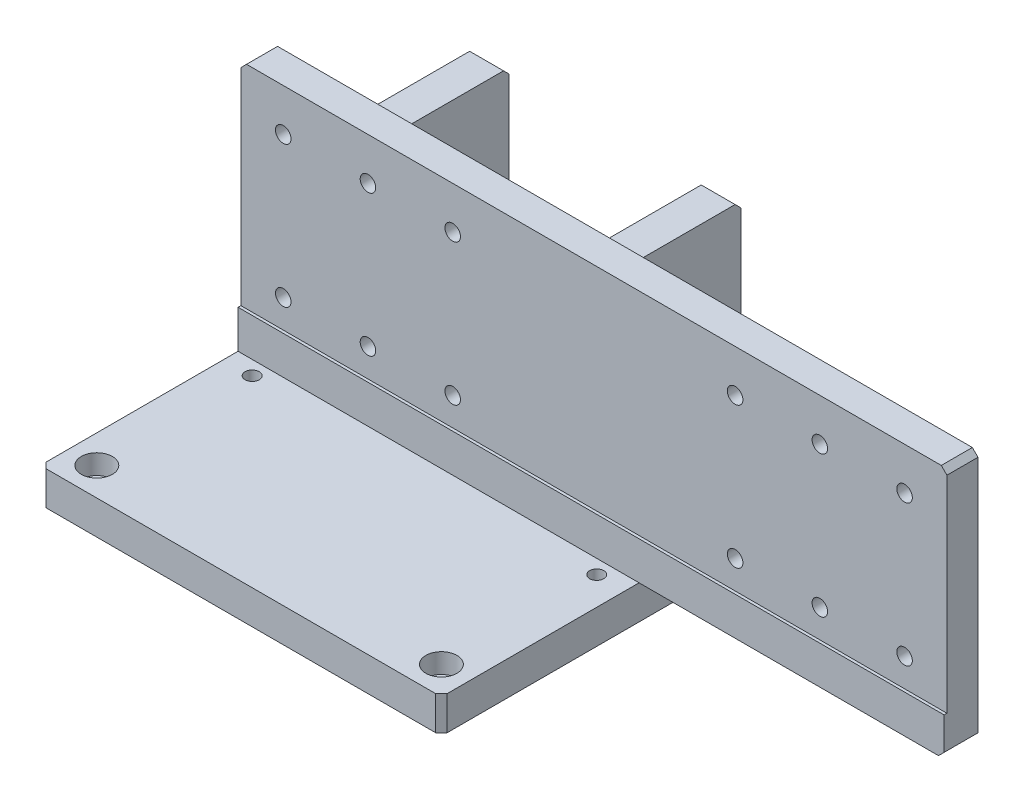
from build123d import *

# Parameters (mm, degrees)
SKETCH_1_W                  = 142
SKETCH_1_H                  = 130
EXTRUDE_1_DEPTH             = 12
SKETCH_2_W                  = 250
SKETCH_2_H                  = 12
EXTRUDE_2_DEPTH             = 88.5
SKETCH_3_W                  = 12
SKETCH_3_H                  = 48
EXTRUDE_3_DEPTH             = 75
EXTRUDE_3_2_DEPTH           = 75
CUT_EXTRUDE_1_DEPTH         = 179.183192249
CUT_EXTRUDE_1_DEPTH_BACK    = 179.183192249
HOLE_WIZARD_M6_1_AT_2_COUNT = 2
HOLE_WIZARD_M6_1_AT_2_PITCH = 122
HOLE_WIZARD_M6_1_AT_3_COUNT = 2
HOLE_WIZARD_M6_1_AT_3_PITCH = 110
HOLE_WIZARD_M6_1_AT_4_COUNT = 2
HOLE_WIZARD_M6_1_AT_4_PITCH = 164.268073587
SKETCH_8_W                  = 2.5
SKETCH_8_H                  = 12
F_5_0MM_1_AT_2_COUNT        = 2
F_5_0MM_1_AT_2_PITCH        = 122
HOLE_WIZARD_M5_1_AT_2_COUNT = 2
HOLE_WIZARD_M5_1_AT_2_PITCH = 30
HOLE_WIZARD_M5_1_AT_3_COUNT = 2
HOLE_WIZARD_M5_1_AT_3_PITCH = 60
HOLE_WIZARD_M5_1_AT_4_COUNT = 2
HOLE_WIZARD_M5_1_AT_4_PITCH = 50
HOLE_WIZARD_M5_1_AT_5_COUNT = 2
HOLE_WIZARD_M5_1_AT_5_PITCH = 58.309518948
HOLE_WIZARD_M5_1_AT_6_COUNT = 2
HOLE_WIZARD_M5_1_AT_6_PITCH = 78.102496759
HOLE_WIZARD_M4_1_AT_2_COUNT = 2
HOLE_WIZARD_M4_1_AT_2_PITCH = 28
PATTERN_LINEAR_1_COUNT      = 2
PATTERN_LINEAR_1_PITCH      = 160
SKETCH_13_W                 = 250
SKETCH_13_H                 = 75
CUT_EXTRUDE_2_DEPTH         = 1
CHAMFER_3_SIZE              = 2
CHAMFER_4_SIZE              = 2


with BuildPart() as part:
    # Sketch 1 → Extrude 1 (new body)
    with BuildSketch(Plane(origin=(0, 0, 0), x_dir=(1, 0, 0), z_dir=(0, 1, 0))):
        Rectangle(SKETCH_1_W, SKETCH_1_H)
    extrude(amount=EXTRUDE_1_DEPTH)

    # Sketch 6 → Hole Wizard M6 _ _ _ _ _1 (revolve, cut)
    with BuildSketch(Plane(origin=(-61, 12, -55), x_dir=(0, 0, 1), z_dir=(1, 0, 0))):
        Polygon((0, 0), (0, 12), (3.3, 12), (3.3, 7), (5.5, 7), (5.5, 0), align=None)
    hole_wizard_m6_1 = revolve(axis=Axis((-61, 18.35, -55), (0, -1, 0)), mode=Mode.SUBTRACT)

    # Hole Wizard M6 _ _ _ _ _1 at 2: Hole Wizard M6 _ _ _ _ _1 ×2
    with Locations(*[(i * HOLE_WIZARD_M6_1_AT_2_PITCH, 0, 0) for i in range(1, HOLE_WIZARD_M6_1_AT_2_COUNT)]):
        add(hole_wizard_m6_1, mode=Mode.SUBTRACT)

    # Hole Wizard M6 _ _ _ _ _1 at 3: Hole Wizard M6 _ _ _ _ _1 ×2
    with Locations(*[(0, 0, i * HOLE_WIZARD_M6_1_AT_3_PITCH) for i in range(1, HOLE_WIZARD_M6_1_AT_3_COUNT)]):
        add(hole_wizard_m6_1, mode=Mode.SUBTRACT)

    # Hole Wizard M6 _ _ _ _ _1 at 4: Hole Wizard M6 _ _ _ _ _1 ×2
    with Locations(*[Vector(0.742688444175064, 0, 0.6696371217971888) * (i * HOLE_WIZARD_M6_1_AT_4_PITCH) for i in range(1, HOLE_WIZARD_M6_1_AT_4_COUNT)]):
        add(hole_wizard_m6_1, mode=Mode.SUBTRACT)

    # Sketch 8 → 5.0mm _ _1 (revolve, cut)
    with BuildSketch(Plane(origin=(-61, 12, 0), x_dir=(0, 0, 1), z_dir=(1, 0, 0))):
        with Locations((1.25, 6)):
            Rectangle(SKETCH_8_W, SKETCH_8_H)
    f_5_0mm_1 = revolve(axis=Axis((-61, 18.35, 0), (0, -1, 0)), mode=Mode.SUBTRACT)

    # 5.0mm _ _1 at 2: 5.0mm _ _1 ×2
    with Locations(*[(i * F_5_0MM_1_AT_2_PITCH, 0, 0) for i in range(1, F_5_0MM_1_AT_2_COUNT)]):
        add(f_5_0mm_1, mode=Mode.SUBTRACT)

    # Sketch 12 → Hole Wizard M4 _ _1 (revolve, cut)
    with BuildSketch(Plane(origin=(-71, 6, -51), x_dir=(0, 0, 1), z_dir=(0, 1, 0))):
        Polygon((0, 0), (0, 4.991420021), (1.65, 4), (1.65, 0.375), (2.025, 0), align=None)
    hole_wizard_m4_1 = revolve(axis=Axis((-77.35, 6, -51), (1, 0, 0)), mode=Mode.SUBTRACT)

    # Hole Wizard M4 _ _1 at 2: Hole Wizard M4 _ _1 ×2
    with Locations(*[(0, 0, i * HOLE_WIZARD_M4_1_AT_2_PITCH) for i in range(1, HOLE_WIZARD_M4_1_AT_2_COUNT)]):
        add(hole_wizard_m4_1, mode=Mode.SUBTRACT)

    # Chamfer 4
    chamfer_4_edges = [part.edges().sort_by_distance(p)[0] for p in [
        (71, 6, 65),
        (-71, 6, 65),
        (-71, 6, -65),
        (71, 6, -65),
    ]]
    chamfer(chamfer_4_edges, length=CHAMFER_4_SIZE)


with BuildPart() as body_2:
    # Sketch 2 → Extrude 2 (new body)
    with BuildSketch(Plane(origin=(0, 12, 0), x_dir=(1, 0, 0), z_dir=(0, 1, 0))):
        with Locations((54, 11)):
            Rectangle(SKETCH_2_W, SKETCH_2_H)
    extrude(amount=EXTRUDE_2_DEPTH)

    # Sketch 10 → Hole Wizard M5 _ _ _ _ _1 (revolve, cut)
    with BuildSketch(Plane(origin=(4, 85.5, -17), x_dir=(0, 1, 0), z_dir=(1, 0, 0))):
        Polygon((0, 0), (0, 12), (2.75, 12), (2.75, 6), (4.75, 6), (4.75, 0), align=None)
    hole_wizard_m5_1 = revolve(axis=Axis((4, 85.5, -23.35), (0, 0, 1)), mode=Mode.SUBTRACT)

    # Hole Wizard M5 _ _ _ _ _1 at 2: Hole Wizard M5 _ _ _ _ _1 ×2
    with Locations(*[(-i * HOLE_WIZARD_M5_1_AT_2_PITCH, 0, 0) for i in range(1, HOLE_WIZARD_M5_1_AT_2_COUNT)]):
        add(hole_wizard_m5_1, mode=Mode.SUBTRACT)

    # Hole Wizard M5 _ _ _ _ _1 at 3: Hole Wizard M5 _ _ _ _ _1 ×2
    with Locations(*[(-i * HOLE_WIZARD_M5_1_AT_3_PITCH, 0, 0) for i in range(1, HOLE_WIZARD_M5_1_AT_3_COUNT)]):
        add(hole_wizard_m5_1, mode=Mode.SUBTRACT)

    # Hole Wizard M5 _ _ _ _ _1 at 4: Hole Wizard M5 _ _ _ _ _1 ×2
    with Locations(*[(0, -i * HOLE_WIZARD_M5_1_AT_4_PITCH, 0) for i in range(1, HOLE_WIZARD_M5_1_AT_4_COUNT)]):
        add(hole_wizard_m5_1, mode=Mode.SUBTRACT)

    # Hole Wizard M5 _ _ _ _ _1 at 5: Hole Wizard M5 _ _ _ _ _1 ×2
    with Locations(*[Vector(-0.5144957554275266, -0.8574929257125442, 0) * (i * HOLE_WIZARD_M5_1_AT_5_PITCH) for i in range(1, HOLE_WIZARD_M5_1_AT_5_COUNT)]):
        add(hole_wizard_m5_1, mode=Mode.SUBTRACT)

    # Hole Wizard M5 _ _ _ _ _1 at 6: Hole Wizard M5 _ _ _ _ _1 ×2
    with Locations(*[Vector(-0.7682212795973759, -0.6401843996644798, 0) * (i * HOLE_WIZARD_M5_1_AT_6_PITCH) for i in range(1, HOLE_WIZARD_M5_1_AT_6_COUNT)]):
        add(hole_wizard_m5_1, mode=Mode.SUBTRACT)

    # Pattern Linear 1: Hole Wizard M5 _ _ _ _ _1 ×2
    with Locations(*[(i * PATTERN_LINEAR_1_PITCH, 0, 0) for i in range(1, PATTERN_LINEAR_1_COUNT)]):
        add(hole_wizard_m5_1, mode=Mode.SUBTRACT)

    # Pattern Linear 1 copy 1 sketch → Pattern Linear 1 copy 1 (revolve, cut)
    with BuildSketch(Plane(origin=(134, 85.5, -17), x_dir=(0, 1, 0), z_dir=(1, 0, 0))):
        Polygon((0, 0), (0, 12), (2.75, 12), (2.75, 6), (4.75, 6), (4.75, 0), align=None)
    revolve(axis=Axis((134, 85.5, -23.35), (0, 0, 1)), mode=Mode.SUBTRACT)

    # Pattern Linear 1 copy 2 sketch → Pattern Linear 1 copy 2 (revolve, cut)
    with BuildSketch(Plane(origin=(104, 85.5, -17), x_dir=(0, 1, 0), z_dir=(1, 0, 0))):
        Polygon((0, 0), (0, 12), (2.75, 12), (2.75, 6), (4.75, 6), (4.75, 0), align=None)
    revolve(axis=Axis((104, 85.5, -23.35), (0, 0, 1)), mode=Mode.SUBTRACT)

    # Pattern Linear 1 copy 3 sketch → Pattern Linear 1 copy 3 (revolve, cut)
    with BuildSketch(Plane(origin=(164, 35.5, -17), x_dir=(0, 1, 0), z_dir=(1, 0, 0))):
        Polygon((0, 0), (0, 12), (2.75, 12), (2.75, 6), (4.75, 6), (4.75, 0), align=None)
    revolve(axis=Axis((164, 35.5, -23.35), (0, 0, 1)), mode=Mode.SUBTRACT)

    # Pattern Linear 1 copy 4 sketch → Pattern Linear 1 copy 4 (revolve, cut)
    with BuildSketch(Plane(origin=(134, 35.5, -17), x_dir=(0, 1, 0), z_dir=(1, 0, 0))):
        Polygon((0, 0), (0, 12), (2.75, 12), (2.75, 6), (4.75, 6), (4.75, 0), align=None)
    revolve(axis=Axis((134, 35.5, -23.35), (0, 0, 1)), mode=Mode.SUBTRACT)

    # Pattern Linear 1 copy 5 sketch → Pattern Linear 1 copy 5 (revolve, cut)
    with BuildSketch(Plane(origin=(104, 35.5, -17), x_dir=(0, 1, 0), z_dir=(1, 0, 0))):
        Polygon((0, 0), (0, 12), (2.75, 12), (2.75, 6), (4.75, 6), (4.75, 0), align=None)
    revolve(axis=Axis((104, 35.5, -23.35), (0, 0, 1)), mode=Mode.SUBTRACT)

    # Sketch 13 → Cut-Extrude 2 (cut)
    with BuildSketch(Plane.XY.offset(-5)):
        with Locations((54, 63)):
            Rectangle(SKETCH_13_W, SKETCH_13_H)
    extrude(amount=-CUT_EXTRUDE_2_DEPTH, mode=Mode.SUBTRACT)

    # Chamfer 3
    chamfer_3_edges = [body_2.edges().sort_by_distance(p)[0] for p in [
        (179, 100.5, -11.5),
        (-71, 100.5, -11.5),
        (179, 12, -11),
    ]]
    chamfer(chamfer_3_edges, length=CHAMFER_3_SIZE)


with BuildPart() as body_3:
    # Sketch 3 → Extrude 3 (new body)
    with BuildSketch(Plane(origin=(0, 12, 0), x_dir=(1, 0, 0), z_dir=(0, 1, 0))):
        with Locations((-41, 41)):
            Rectangle(SKETCH_3_W, SKETCH_3_H)
    extrude(amount=EXTRUDE_3_DEPTH)


with BuildPart() as body_4:
    # Sketch 3 → Extrude 3 2 (new body)
    with BuildSketch(Plane(origin=(0, 12, 0), x_dir=(1, 0, 0), z_dir=(0, 1, 0))):
        with Locations((41, 41)):
            Rectangle(SKETCH_3_W, SKETCH_3_H)
    extrude(amount=EXTRUDE_3_2_DEPTH)


with BuildPart() as cut_extrude_1_tool:
    # Sketch 4 → Cut-Extrude 1 (new, two sides: drawn at the far end of the back side and taken through both)
    with BuildSketch(Plane(origin=(47, 0, 0), x_dir=(0, 0, -1), z_dir=(1, 0, 0)).offset(-CUT_EXTRUDE_1_DEPTH_BACK)):
        Polygon((65, 87), (63, 87), (65, 85), align=None)
    extrude(amount=CUT_EXTRUDE_1_DEPTH + CUT_EXTRUDE_1_DEPTH_BACK)


with BuildPart() as body_3_1:
    add(body_3.part)

    # Cut-Extrude 1: cut by cut_extrude_1_tool
    add(cut_extrude_1_tool.part, mode=Mode.SUBTRACT)


with BuildPart() as body_4_1:
    add(body_4.part)

    # Cut-Extrude 1: cut by cut_extrude_1_tool
    add(cut_extrude_1_tool.part, mode=Mode.SUBTRACT)


solid = Compound([part.part, body_2.part, body_3_1.part, body_4_1.part])
